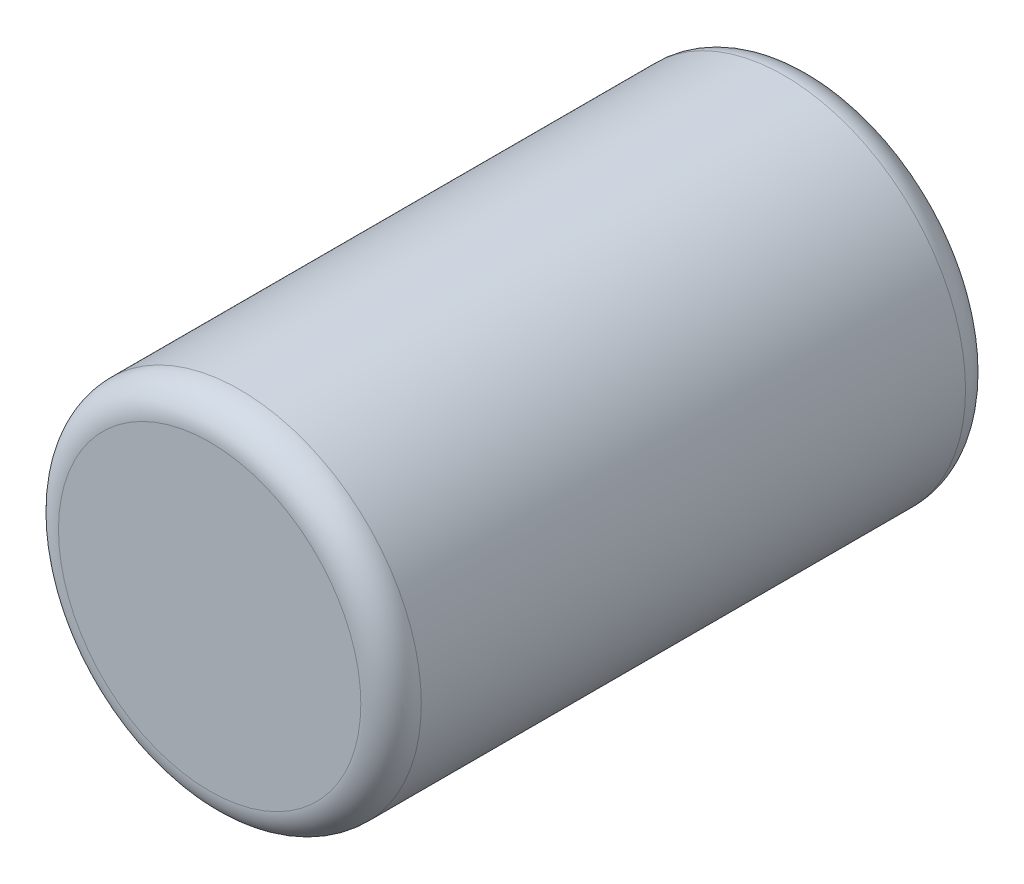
ISO-10303-21;
HEADER;
FILE_DESCRIPTION(('STEP AP214'),'2;1');
FILE_NAME('part.step','',(''),(''),'','','');
FILE_SCHEMA(('AUTOMOTIVE_DESIGN { 1 0 10303 214 1 1 1 1 }'));
ENDSEC;
DATA;
#1=APPLICATION_CONTEXT('core data for automotive mechanical design processes');
#2=APPLICATION_PROTOCOL_DEFINITION('international standard','automotive_design',2000,#1);
#3=PRODUCT_CONTEXT('',#1,'mechanical');
#4=PRODUCT('Part','Part','',(#3));
#5=PRODUCT_RELATED_PRODUCT_CATEGORY('part','',(#4));
#6=PRODUCT_DEFINITION_FORMATION('','',#4);
#7=PRODUCT_DEFINITION_CONTEXT('part definition',#1,'design');
#8=PRODUCT_DEFINITION('design','',#6,#7);
#9=PRODUCT_DEFINITION_SHAPE('','',#8);
#10=(LENGTH_UNIT() NAMED_UNIT(*) SI_UNIT(.MILLI.,.METRE.));
#11=(NAMED_UNIT(*) PLANE_ANGLE_UNIT() SI_UNIT($,.RADIAN.));
#12=(NAMED_UNIT(*) SI_UNIT($,.STERADIAN.) SOLID_ANGLE_UNIT());
#13=UNCERTAINTY_MEASURE_WITH_UNIT(LENGTH_MEASURE(1.E-05),#10,'distance_accuracy_value','');
#14=(GEOMETRIC_REPRESENTATION_CONTEXT(3) GLOBAL_UNCERTAINTY_ASSIGNED_CONTEXT((#13)) GLOBAL_UNIT_ASSIGNED_CONTEXT((#10,
#11,#12)) REPRESENTATION_CONTEXT('',''));
#15=CARTESIAN_POINT('',(0.,0.,0.));
#16=DIRECTION('',(0.,0.,1.));
#17=DIRECTION('',(1.,0.,0.));
#18=AXIS2_PLACEMENT_3D('',#15,#16,#17);
#19=CARTESIAN_POINT('',(0.,0.,5.));
#20=DIRECTION('',(0.,0.,-1.));
#21=DIRECTION('',(-1.,0.,0.));
#22=AXIS2_PLACEMENT_3D('',#19,#20,#21);
#23=CYLINDRICAL_SURFACE('',#22,3.);
#24=CARTESIAN_POINT('',(0.,0.,-4.5));
#25=DIRECTION('',(0.,0.,1.));
#26=DIRECTION('',(1.,0.,0.));
#27=AXIS2_PLACEMENT_3D('',#24,#25,#26);
#28=CIRCLE('',#27,3.);
#29=CARTESIAN_POINT('',(3.,0.,-4.5));
#30=VERTEX_POINT('',#29);
#31=EDGE_CURVE('E40',#30,#30,#28,.T.);
#32=ORIENTED_EDGE('',*,*,#31,.T.);
#33=EDGE_LOOP('',(#32));
#34=FACE_BOUND('',#33,.T.);
#35=CARTESIAN_POINT('',(0.,0.,4.5));
#36=DIRECTION('',(0.,0.,1.));
#37=DIRECTION('',(1.,0.,0.));
#38=AXIS2_PLACEMENT_3D('',#35,#36,#37);
#39=CIRCLE('',#38,3.);
#40=CARTESIAN_POINT('',(3.,0.,4.5));
#41=VERTEX_POINT('',#40);
#42=EDGE_CURVE('E44',#41,#41,#39,.F.);
#43=ORIENTED_EDGE('',*,*,#42,.T.);
#44=EDGE_LOOP('',(#43));
#45=FACE_BOUND('',#44,.T.);
#46=ADVANCED_FACE('F29',(#34,#45),#23,.T.);
#47=CARTESIAN_POINT('',(0.,0.,5.));
#48=DIRECTION('',(0.,0.,1.));
#49=DIRECTION('',(1.,0.,0.));
#50=AXIS2_PLACEMENT_3D('',#47,#48,#49);
#51=PLANE('',#50);
#52=CARTESIAN_POINT('',(0.,0.,5.));
#53=DIRECTION('',(0.,0.,1.));
#54=DIRECTION('',(1.,0.,0.));
#55=AXIS2_PLACEMENT_3D('',#52,#53,#54);
#56=CIRCLE('',#55,2.5);
#57=CARTESIAN_POINT('',(2.5,0.,5.));
#58=VERTEX_POINT('',#57);
#59=EDGE_CURVE('E10',#58,#58,#56,.T.);
#60=ORIENTED_EDGE('',*,*,#59,.T.);
#61=EDGE_LOOP('',(#60));
#62=FACE_BOUND('',#61,.T.);
#63=ADVANCED_FACE('F60',(#62),#51,.T.);
#64=CARTESIAN_POINT('',(0.,0.,-5.));
#65=DIRECTION('',(0.,0.,1.));
#66=DIRECTION('',(1.,0.,0.));
#67=AXIS2_PLACEMENT_3D('',#64,#65,#66);
#68=PLANE('',#67);
#69=CARTESIAN_POINT('',(0.,0.,-5.));
#70=DIRECTION('',(0.,0.,1.));
#71=DIRECTION('',(1.,0.,0.));
#72=AXIS2_PLACEMENT_3D('',#69,#70,#71);
#73=CIRCLE('',#72,2.5);
#74=CARTESIAN_POINT('',(2.5,0.,-5.));
#75=VERTEX_POINT('',#74);
#76=EDGE_CURVE('E36',#75,#75,#73,.F.);
#77=ORIENTED_EDGE('',*,*,#76,.T.);
#78=EDGE_LOOP('',(#77));
#79=FACE_BOUND('',#78,.T.);
#80=ADVANCED_FACE('F57',(#79),#68,.F.);
#81=CARTESIAN_POINT('',(0.,0.,-4.5));
#82=DIRECTION('',(0.,0.,1.));
#83=DIRECTION('',(1.,0.,0.));
#84=AXIS2_PLACEMENT_3D('',#81,#82,#83);
#85=TOROIDAL_SURFACE('',#84,2.5,0.5);
#86=ORIENTED_EDGE('',*,*,#76,.F.);
#87=EDGE_LOOP('',(#86));
#88=FACE_BOUND('',#87,.T.);
#89=ORIENTED_EDGE('',*,*,#31,.F.);
#90=EDGE_LOOP('',(#89));
#91=FACE_BOUND('',#90,.T.);
#92=ADVANCED_FACE('F53',(#88,#91),#85,.T.);
#93=CARTESIAN_POINT('',(0.,0.,4.5));
#94=DIRECTION('',(0.,0.,1.));
#95=DIRECTION('',(1.,0.,0.));
#96=AXIS2_PLACEMENT_3D('',#93,#94,#95);
#97=TOROIDAL_SURFACE('',#96,2.5,0.5);
#98=ORIENTED_EDGE('',*,*,#42,.F.);
#99=EDGE_LOOP('',(#98));
#100=FACE_BOUND('',#99,.T.);
#101=ORIENTED_EDGE('',*,*,#59,.F.);
#102=EDGE_LOOP('',(#101));
#103=FACE_BOUND('',#102,.T.);
#104=ADVANCED_FACE('F31',(#100,#103),#97,.T.);
#105=CLOSED_SHELL('',(#46,#63,#80,#92,#104));
#106=MANIFOLD_SOLID_BREP('B2',#105);
#107=ADVANCED_BREP_SHAPE_REPRESENTATION('',(#18,#106),#14);
#108=SHAPE_DEFINITION_REPRESENTATION(#9,#107);
ENDSEC;
END-ISO-10303-21;
